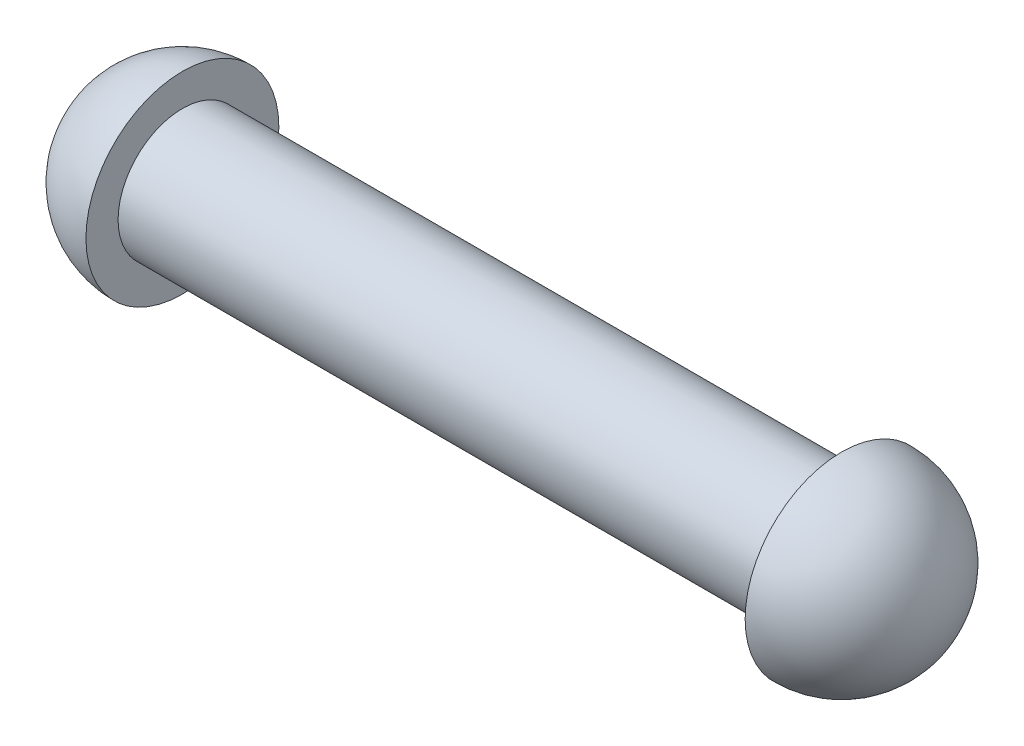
from build123d import *


with BuildPart() as part:
    # Esquisse1 → R_volution1 (revolve)
    with BuildSketch(Plane.XY):
        with BuildLine():
            Line((0, 6), (0, 4))
            Line((0, 4), (41, 4))
            Line((41, 4), (41, 6))
            ThreePointArc((41, 6), (45.242640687, 4.242640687), (47, 0))
            Line((47, 0), (-6, 0))
            ThreePointArc((-6, 0), (-4.242640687, 4.242640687), (0, 6))
        make_face()
    revolve(axis=Axis((-6, 0, 0), (1, 0, 0)))


solid = part.part
